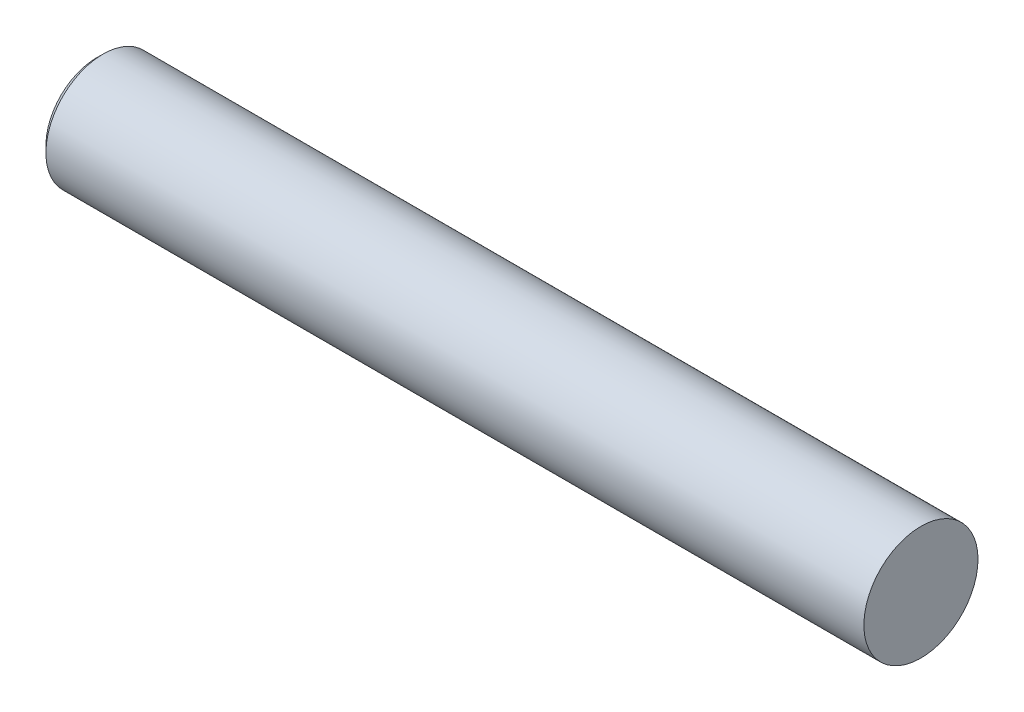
from build123d import *

# Parameters (mm, degrees)
SKETCH1_R           = 9
BOSS_EXTRUDE1_DEPTH = 130
CHAMFER1_SIZE       = 1


with BuildPart() as part:
    # Sketch1 → Boss-Extrude1 (new body)
    with BuildSketch(Plane(origin=(0, 0, 0), x_dir=(0, 0, -1), z_dir=(1, 0, 0))):
        Circle(SKETCH1_R)
    extrude(amount=BOSS_EXTRUDE1_DEPTH)

    # Chamfer1
    chamfer1_edges = [part.edges().sort_by_distance(p)[0] for p in [
        (0, 0, 9),
    ]]
    chamfer(chamfer1_edges, length=CHAMFER1_SIZE)


solid = part.part
